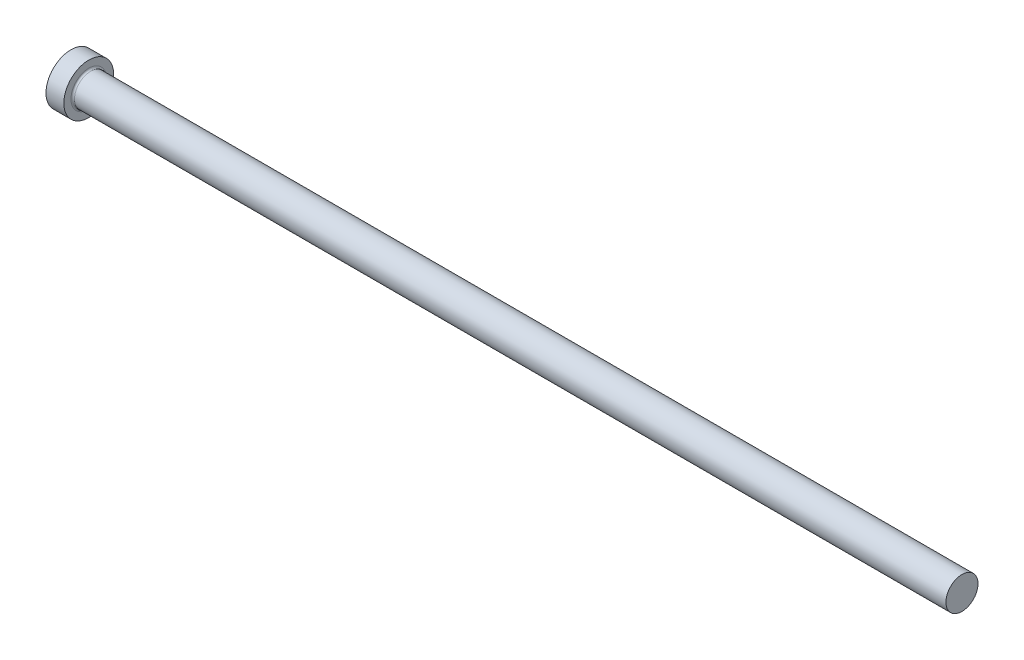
ISO-10303-21;
HEADER;
FILE_DESCRIPTION(('STEP AP214'),'2;1');
FILE_NAME('part.step','',(''),(''),'','','');
FILE_SCHEMA(('AUTOMOTIVE_DESIGN { 1 0 10303 214 1 1 1 1 }'));
ENDSEC;
DATA;
#1=APPLICATION_CONTEXT('core data for automotive mechanical design processes');
#2=APPLICATION_PROTOCOL_DEFINITION('international standard','automotive_design',2000,#1);
#3=PRODUCT_CONTEXT('',#1,'mechanical');
#4=PRODUCT('Part','Part','',(#3));
#5=PRODUCT_RELATED_PRODUCT_CATEGORY('part','',(#4));
#6=PRODUCT_DEFINITION_FORMATION('','',#4);
#7=PRODUCT_DEFINITION_CONTEXT('part definition',#1,'design');
#8=PRODUCT_DEFINITION('design','',#6,#7);
#9=PRODUCT_DEFINITION_SHAPE('','',#8);
#10=(LENGTH_UNIT() NAMED_UNIT(*) SI_UNIT(.MILLI.,.METRE.));
#11=(NAMED_UNIT(*) PLANE_ANGLE_UNIT() SI_UNIT($,.RADIAN.));
#12=(NAMED_UNIT(*) SI_UNIT($,.STERADIAN.) SOLID_ANGLE_UNIT());
#13=UNCERTAINTY_MEASURE_WITH_UNIT(LENGTH_MEASURE(1.E-05),#10,'distance_accuracy_value','');
#14=(GEOMETRIC_REPRESENTATION_CONTEXT(3) GLOBAL_UNCERTAINTY_ASSIGNED_CONTEXT((#13)) GLOBAL_UNIT_ASSIGNED_CONTEXT((#10,
#11,#12)) REPRESENTATION_CONTEXT('',''));
#15=CARTESIAN_POINT('',(0.,0.,0.));
#16=DIRECTION('',(0.,0.,1.));
#17=DIRECTION('',(1.,0.,0.));
#18=AXIS2_PLACEMENT_3D('',#15,#16,#17);
#19=CARTESIAN_POINT('',(0.,0.,0.));
#20=DIRECTION('',(-1.,0.,0.));
#21=DIRECTION('',(0.,-1.,0.));
#22=AXIS2_PLACEMENT_3D('',#19,#20,#21);
#23=PLANE('',#22);
#24=CARTESIAN_POINT('',(0.,0.,0.));
#25=DIRECTION('',(1.,0.,0.));
#26=DIRECTION('',(0.,1.,0.));
#27=AXIS2_PLACEMENT_3D('',#24,#25,#26);
#28=CIRCLE('',#27,7.);
#29=CARTESIAN_POINT('',(0.,7.,0.));
#30=VERTEX_POINT('',#29);
#31=EDGE_CURVE('E25',#30,#30,#28,.T.);
#32=ORIENTED_EDGE('',*,*,#31,.F.);
#33=EDGE_LOOP('',(#32));
#34=FACE_BOUND('',#33,.T.);
#35=ADVANCED_FACE('F14',(#34),#23,.T.);
#36=CARTESIAN_POINT('',(250.,0.,0.));
#37=DIRECTION('',(1.,0.,0.));
#38=DIRECTION('',(0.,1.,0.));
#39=AXIS2_PLACEMENT_3D('',#36,#37,#38);
#40=CYLINDRICAL_SURFACE('',#39,7.);
#41=ORIENTED_EDGE('',*,*,#31,.T.);
#42=EDGE_LOOP('',(#41));
#43=FACE_BOUND('',#42,.T.);
#44=CARTESIAN_POINT('',(5.,0.,0.));
#45=DIRECTION('',(1.,0.,0.));
#46=DIRECTION('',(0.,1.,0.));
#47=AXIS2_PLACEMENT_3D('',#44,#45,#46);
#48=CIRCLE('',#47,7.);
#49=CARTESIAN_POINT('',(5.,7.,0.));
#50=VERTEX_POINT('',#49);
#51=EDGE_CURVE('E29',#50,#50,#48,.T.);
#52=ORIENTED_EDGE('',*,*,#51,.F.);
#53=EDGE_LOOP('',(#52));
#54=FACE_BOUND('',#53,.T.);
#55=ADVANCED_FACE('F51',(#43,#54),#40,.T.);
#56=CARTESIAN_POINT('',(5.,7.,0.));
#57=DIRECTION('',(1.,0.,0.));
#58=DIRECTION('',(0.,1.,0.));
#59=AXIS2_PLACEMENT_3D('',#56,#57,#58);
#60=PLANE('',#59);
#61=CARTESIAN_POINT('',(5.,0.,0.));
#62=DIRECTION('',(1.,0.,0.));
#63=DIRECTION('',(0.,1.,0.));
#64=AXIS2_PLACEMENT_3D('',#61,#62,#63);
#65=CIRCLE('',#64,4.99999999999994);
#66=CARTESIAN_POINT('',(5.,4.99999999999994,0.));
#67=VERTEX_POINT('',#66);
#68=EDGE_CURVE('E9',#67,#67,#65,.F.);
#69=ORIENTED_EDGE('',*,*,#68,.T.);
#70=EDGE_LOOP('',(#69));
#71=FACE_BOUND('',#70,.T.);
#72=ORIENTED_EDGE('',*,*,#51,.T.);
#73=EDGE_LOOP('',(#72));
#74=FACE_BOUND('',#73,.T.);
#75=ADVANCED_FACE('F42',(#71,#74),#60,.T.);
#76=CARTESIAN_POINT('',(250.,0.,0.));
#77=DIRECTION('',(1.,0.,0.));
#78=DIRECTION('',(0.,1.,0.));
#79=AXIS2_PLACEMENT_3D('',#76,#77,#78);
#80=CYLINDRICAL_SURFACE('',#79,4.49999999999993);
#81=CARTESIAN_POINT('',(5.5,0.,0.));
#82=DIRECTION('',(1.,0.,0.));
#83=DIRECTION('',(0.,1.,0.));
#84=AXIS2_PLACEMENT_3D('',#81,#82,#83);
#85=CIRCLE('',#84,4.49999999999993);
#86=CARTESIAN_POINT('',(5.5,4.49999999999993,0.));
#87=VERTEX_POINT('',#86);
#88=EDGE_CURVE('E21',#87,#87,#85,.T.);
#89=ORIENTED_EDGE('',*,*,#88,.T.);
#90=EDGE_LOOP('',(#89));
#91=FACE_BOUND('',#90,.T.);
#92=CARTESIAN_POINT('',(250.,0.,0.));
#93=DIRECTION('',(1.,0.,0.));
#94=DIRECTION('',(0.,1.,0.));
#95=AXIS2_PLACEMENT_3D('',#92,#93,#94);
#96=CIRCLE('',#95,4.5);
#97=CARTESIAN_POINT('',(250.,4.50000000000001,0.));
#98=VERTEX_POINT('',#97);
#99=EDGE_CURVE('E34',#98,#98,#96,.T.);
#100=ORIENTED_EDGE('',*,*,#99,.F.);
#101=EDGE_LOOP('',(#100));
#102=FACE_BOUND('',#101,.T.);
#103=ADVANCED_FACE('F40',(#91,#102),#80,.T.);
#104=CARTESIAN_POINT('',(250.,4.5,0.));
#105=DIRECTION('',(1.,0.,0.));
#106=DIRECTION('',(0.,1.,0.));
#107=AXIS2_PLACEMENT_3D('',#104,#105,#106);
#108=PLANE('',#107);
#109=ORIENTED_EDGE('',*,*,#99,.T.);
#110=EDGE_LOOP('',(#109));
#111=FACE_BOUND('',#110,.T.);
#112=ADVANCED_FACE('F38',(#111),#108,.T.);
#113=CARTESIAN_POINT('',(5.5,0.,0.));
#114=DIRECTION('',(1.,0.,0.));
#115=DIRECTION('',(0.,1.,0.));
#116=AXIS2_PLACEMENT_3D('',#113,#114,#115);
#117=TOROIDAL_SURFACE('',#116,4.99999999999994,0.5);
#118=ORIENTED_EDGE('',*,*,#68,.F.);
#119=EDGE_LOOP('',(#118));
#120=FACE_BOUND('',#119,.T.);
#121=ORIENTED_EDGE('',*,*,#88,.F.);
#122=EDGE_LOOP('',(#121));
#123=FACE_BOUND('',#122,.T.);
#124=ADVANCED_FACE('F16',(#120,#123),#117,.F.);
#125=CLOSED_SHELL('',(#35,#55,#75,#103,#112,#124));
#126=MANIFOLD_SOLID_BREP('B1',#125);
#127=ADVANCED_BREP_SHAPE_REPRESENTATION('',(#18,#126),#14);
#128=SHAPE_DEFINITION_REPRESENTATION(#9,#127);
ENDSEC;
END-ISO-10303-21;
